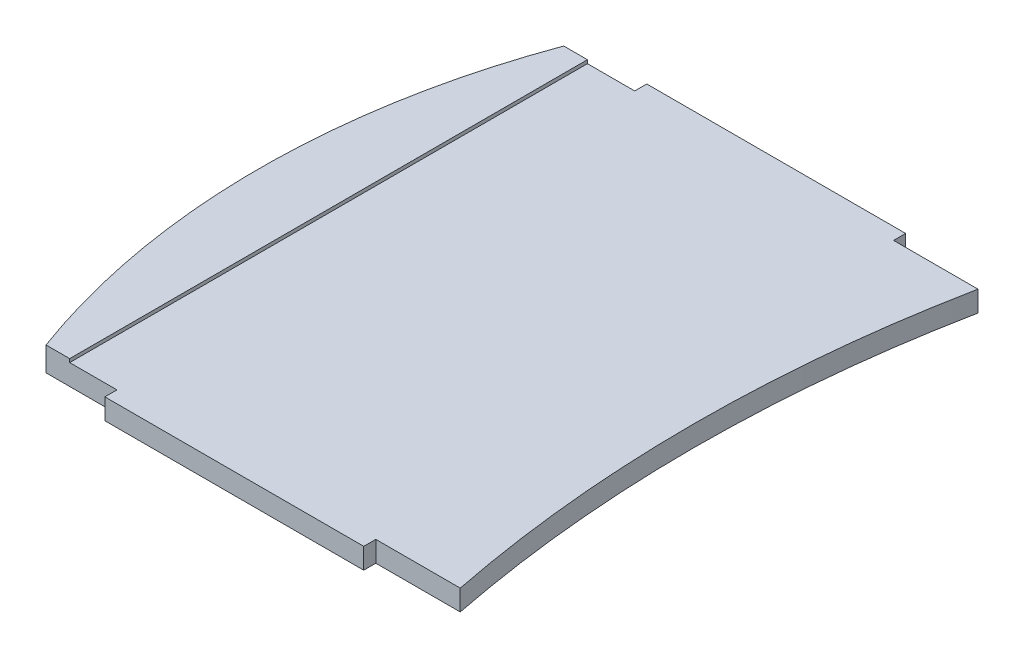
ISO-10303-21;
HEADER;
FILE_DESCRIPTION(('STEP AP214'),'2;1');
FILE_NAME('part.step','',(''),(''),'','','');
FILE_SCHEMA(('AUTOMOTIVE_DESIGN { 1 0 10303 214 1 1 1 1 }'));
ENDSEC;
DATA;
#1=APPLICATION_CONTEXT('core data for automotive mechanical design processes');
#2=APPLICATION_PROTOCOL_DEFINITION('international standard','automotive_design',2000,#1);
#3=PRODUCT_CONTEXT('',#1,'mechanical');
#4=PRODUCT('Part','Part','',(#3));
#5=PRODUCT_RELATED_PRODUCT_CATEGORY('part','',(#4));
#6=PRODUCT_DEFINITION_FORMATION('','',#4);
#7=PRODUCT_DEFINITION_CONTEXT('part definition',#1,'design');
#8=PRODUCT_DEFINITION('design','',#6,#7);
#9=PRODUCT_DEFINITION_SHAPE('','',#8);
#10=(LENGTH_UNIT() NAMED_UNIT(*) SI_UNIT(.MILLI.,.METRE.));
#11=(NAMED_UNIT(*) PLANE_ANGLE_UNIT() SI_UNIT($,.RADIAN.));
#12=(NAMED_UNIT(*) SI_UNIT($,.STERADIAN.) SOLID_ANGLE_UNIT());
#13=UNCERTAINTY_MEASURE_WITH_UNIT(LENGTH_MEASURE(1.E-05),#10,'distance_accuracy_value','');
#14=(GEOMETRIC_REPRESENTATION_CONTEXT(3) GLOBAL_UNCERTAINTY_ASSIGNED_CONTEXT((#13)) GLOBAL_UNIT_ASSIGNED_CONTEXT((#10,
#11,#12)) REPRESENTATION_CONTEXT('',''));
#15=CARTESIAN_POINT('',(0.,0.,0.));
#16=DIRECTION('',(0.,0.,1.));
#17=DIRECTION('',(1.,0.,0.));
#18=AXIS2_PLACEMENT_3D('',#15,#16,#17);
#19=CARTESIAN_POINT('',(-177.216217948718,12.,-182.316442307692));
#20=DIRECTION('',(0.,0.,1.));
#21=DIRECTION('',(1.,0.,0.));
#22=AXIS2_PLACEMENT_3D('',#19,#20,#21);
#23=PLANE('',#22);
#24=DIRECTION('',(-1.,0.,0.));
#25=VECTOR('',#24,1.);
#26=CARTESIAN_POINT('',(-177.216217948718,0.,-182.316442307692));
#27=LINE('',#26,#25);
#28=CARTESIAN_POINT('',(-177.216217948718,0.,-182.316442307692));
#29=VERTEX_POINT('',#28);
#30=CARTESIAN_POINT('',(-218.313277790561,0.,-182.316442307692));
#31=VERTEX_POINT('',#30);
#32=EDGE_CURVE('E133',#29,#31,#27,.T.);
#33=ORIENTED_EDGE('',*,*,#32,.T.);
#34=DIRECTION('',(0.,-1.,0.));
#35=VECTOR('',#34,1.);
#36=CARTESIAN_POINT('',(-218.313277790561,14.,-182.316442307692));
#37=LINE('',#36,#35);
#38=CARTESIAN_POINT('',(-218.313277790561,14.,-182.316442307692));
#39=VERTEX_POINT('',#38);
#40=EDGE_CURVE('E209',#39,#31,#37,.T.);
#41=ORIENTED_EDGE('',*,*,#40,.F.);
#42=DIRECTION('',(1.,0.,0.));
#43=VECTOR('',#42,1.);
#44=CARTESIAN_POINT('',(-204.586217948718,14.,-182.316442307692));
#45=LINE('',#44,#43);
#46=CARTESIAN_POINT('',(-204.586217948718,14.,-182.316442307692));
#47=VERTEX_POINT('',#46);
#48=EDGE_CURVE('E231',#39,#47,#45,.T.);
#49=ORIENTED_EDGE('',*,*,#48,.T.);
#50=DIRECTION('',(0.,-1.,0.));
#51=VECTOR('',#50,1.);
#52=CARTESIAN_POINT('',(-204.586217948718,14.,-182.316442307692));
#53=LINE('',#52,#51);
#54=CARTESIAN_POINT('',(-204.586217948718,12.,-182.316442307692));
#55=VERTEX_POINT('',#54);
#56=EDGE_CURVE('E212',#47,#55,#53,.T.);
#57=ORIENTED_EDGE('',*,*,#56,.T.);
#58=DIRECTION('',(-1.,0.,0.));
#59=VECTOR('',#58,1.);
#60=CARTESIAN_POINT('',(-177.216217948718,12.,-182.316442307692));
#61=LINE('',#60,#59);
#62=CARTESIAN_POINT('',(-177.216217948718,12.,-182.316442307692));
#63=VERTEX_POINT('',#62);
#64=EDGE_CURVE('E153',#63,#55,#61,.T.);
#65=ORIENTED_EDGE('',*,*,#64,.F.);
#66=DIRECTION('',(0.,-1.,0.));
#67=VECTOR('',#66,1.);
#68=CARTESIAN_POINT('',(-177.216217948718,12.,-182.316442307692));
#69=LINE('',#68,#67);
#70=EDGE_CURVE('E129',#63,#29,#69,.T.);
#71=ORIENTED_EDGE('',*,*,#70,.T.);
#72=EDGE_LOOP('',(#33,#41,#49,#57,#65,#71));
#73=FACE_BOUND('',#72,.T.);
#74=ADVANCED_FACE('F32',(#73),#23,.F.);
#75=CARTESIAN_POINT('',(-239.016217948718,12.,117.683557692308));
#76=DIRECTION('',(0.,0.,-1.));
#77=DIRECTION('',(-1.,0.,0.));
#78=AXIS2_PLACEMENT_3D('',#75,#76,#77);
#79=PLANE('',#78);
#80=DIRECTION('',(1.,0.,0.));
#81=VECTOR('',#80,1.);
#82=CARTESIAN_POINT('',(-239.016217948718,12.,117.683557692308));
#83=LINE('',#82,#81);
#84=CARTESIAN_POINT('',(-204.586217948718,12.,117.683557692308));
#85=VERTEX_POINT('',#84);
#86=CARTESIAN_POINT('',(-177.216217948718,12.,117.683557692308));
#87=VERTEX_POINT('',#86);
#88=EDGE_CURVE('E92',#85,#87,#83,.T.);
#89=ORIENTED_EDGE('',*,*,#88,.F.);
#90=DIRECTION('',(0.,-1.,0.));
#91=VECTOR('',#90,1.);
#92=CARTESIAN_POINT('',(-204.586217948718,14.,117.683557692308));
#93=LINE('',#92,#91);
#94=CARTESIAN_POINT('',(-204.586217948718,14.,117.683557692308));
#95=VERTEX_POINT('',#94);
#96=EDGE_CURVE('E216',#95,#85,#93,.T.);
#97=ORIENTED_EDGE('',*,*,#96,.F.);
#98=DIRECTION('',(-1.,0.,0.));
#99=VECTOR('',#98,1.);
#100=CARTESIAN_POINT('',(-204.586217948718,14.,117.683557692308));
#101=LINE('',#100,#99);
#102=CARTESIAN_POINT('',(-218.313277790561,14.,117.683557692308));
#103=VERTEX_POINT('',#102);
#104=EDGE_CURVE('E213',#95,#103,#101,.T.);
#105=ORIENTED_EDGE('',*,*,#104,.T.);
#106=DIRECTION('',(0.,-1.,0.));
#107=VECTOR('',#106,1.);
#108=CARTESIAN_POINT('',(-218.313277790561,14.,117.683557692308));
#109=LINE('',#108,#107);
#110=CARTESIAN_POINT('',(-218.313277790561,0.,117.683557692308));
#111=VERTEX_POINT('',#110);
#112=EDGE_CURVE('E208',#103,#111,#109,.T.);
#113=ORIENTED_EDGE('',*,*,#112,.T.);
#114=DIRECTION('',(1.,0.,0.));
#115=VECTOR('',#114,1.);
#116=CARTESIAN_POINT('',(-239.016217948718,0.,117.683557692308));
#117=LINE('',#116,#115);
#118=CARTESIAN_POINT('',(-177.216217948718,0.,117.683557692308));
#119=VERTEX_POINT('',#118);
#120=EDGE_CURVE('E136',#111,#119,#117,.T.);
#121=ORIENTED_EDGE('',*,*,#120,.T.);
#122=DIRECTION('',(0.,-1.,0.));
#123=VECTOR('',#122,1.);
#124=CARTESIAN_POINT('',(-177.216217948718,12.,117.683557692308));
#125=LINE('',#124,#123);
#126=EDGE_CURVE('E11',#87,#119,#125,.T.);
#127=ORIENTED_EDGE('',*,*,#126,.F.);
#128=EDGE_LOOP('',(#89,#97,#105,#113,#121,#127));
#129=FACE_BOUND('',#128,.T.);
#130=ADVANCED_FACE('F274',(#129),#79,.F.);
#131=CARTESIAN_POINT('',(-177.216217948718,12.,117.683557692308));
#132=DIRECTION('',(1.,0.,0.));
#133=DIRECTION('',(0.,0.,-1.));
#134=AXIS2_PLACEMENT_3D('',#131,#132,#133);
#135=PLANE('',#134);
#136=DIRECTION('',(0.,0.,1.));
#137=VECTOR('',#136,1.);
#138=CARTESIAN_POINT('',(-177.216217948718,0.,117.683557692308));
#139=LINE('',#138,#137);
#140=CARTESIAN_POINT('',(-177.216217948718,0.,124.683557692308));
#141=VERTEX_POINT('',#140);
#142=EDGE_CURVE('E139',#119,#141,#139,.T.);
#143=ORIENTED_EDGE('',*,*,#142,.T.);
#144=DIRECTION('',(0.,-1.,0.));
#145=VECTOR('',#144,1.);
#146=CARTESIAN_POINT('',(-177.216217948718,12.,124.683557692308));
#147=LINE('',#146,#145);
#148=CARTESIAN_POINT('',(-177.216217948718,12.,124.683557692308));
#149=VERTEX_POINT('',#148);
#150=EDGE_CURVE('E40',#149,#141,#147,.T.);
#151=ORIENTED_EDGE('',*,*,#150,.F.);
#152=DIRECTION('',(0.,0.,1.));
#153=VECTOR('',#152,1.);
#154=CARTESIAN_POINT('',(-177.216217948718,12.,117.683557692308));
#155=LINE('',#154,#153);
#156=EDGE_CURVE('E198',#87,#149,#155,.T.);
#157=ORIENTED_EDGE('',*,*,#156,.F.);
#158=ORIENTED_EDGE('',*,*,#126,.T.);
#159=EDGE_LOOP('',(#143,#151,#157,#158));
#160=FACE_BOUND('',#159,.T.);
#161=ADVANCED_FACE('F285',(#160),#135,.F.);
#162=CARTESIAN_POINT('',(-177.216217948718,12.,124.683557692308));
#163=DIRECTION('',(0.,0.,-1.));
#164=DIRECTION('',(-1.,0.,0.));
#165=AXIS2_PLACEMENT_3D('',#162,#163,#164);
#166=PLANE('',#165);
#167=DIRECTION('',(1.,0.,0.));
#168=VECTOR('',#167,1.);
#169=CARTESIAN_POINT('',(-177.216217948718,0.,124.683557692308));
#170=LINE('',#169,#168);
#171=CARTESIAN_POINT('',(-27.216217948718,0.,124.683557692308));
#172=VERTEX_POINT('',#171);
#173=EDGE_CURVE('E141',#141,#172,#170,.T.);
#174=ORIENTED_EDGE('',*,*,#173,.T.);
#175=DIRECTION('',(0.,-1.,0.));
#176=VECTOR('',#175,1.);
#177=CARTESIAN_POINT('',(-27.216217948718,12.,124.683557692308));
#178=LINE('',#177,#176);
#179=CARTESIAN_POINT('',(-27.216217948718,12.,124.683557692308));
#180=VERTEX_POINT('',#179);
#181=EDGE_CURVE('E160',#180,#172,#178,.T.);
#182=ORIENTED_EDGE('',*,*,#181,.F.);
#183=DIRECTION('',(1.,0.,0.));
#184=VECTOR('',#183,1.);
#185=CARTESIAN_POINT('',(-177.216217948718,12.,124.683557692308));
#186=LINE('',#185,#184);
#187=EDGE_CURVE('E169',#149,#180,#186,.T.);
#188=ORIENTED_EDGE('',*,*,#187,.F.);
#189=ORIENTED_EDGE('',*,*,#150,.T.);
#190=EDGE_LOOP('',(#174,#182,#188,#189));
#191=FACE_BOUND('',#190,.T.);
#192=ADVANCED_FACE('F167',(#191),#166,.F.);
#193=CARTESIAN_POINT('',(-27.216217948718,12.,117.683557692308));
#194=DIRECTION('',(-1.,0.,0.));
#195=DIRECTION('',(0.,0.,1.));
#196=AXIS2_PLACEMENT_3D('',#193,#194,#195);
#197=PLANE('',#196);
#198=DIRECTION('',(0.,0.,-1.));
#199=VECTOR('',#198,1.);
#200=CARTESIAN_POINT('',(-27.216217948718,0.,117.683557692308));
#201=LINE('',#200,#199);
#202=CARTESIAN_POINT('',(-27.216217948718,0.,117.683557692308));
#203=VERTEX_POINT('',#202);
#204=EDGE_CURVE('E143',#172,#203,#201,.T.);
#205=ORIENTED_EDGE('',*,*,#204,.T.);
#206=DIRECTION('',(0.,-1.,0.));
#207=VECTOR('',#206,1.);
#208=CARTESIAN_POINT('',(-27.216217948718,12.,117.683557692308));
#209=LINE('',#208,#207);
#210=CARTESIAN_POINT('',(-27.216217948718,12.,117.683557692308));
#211=VERTEX_POINT('',#210);
#212=EDGE_CURVE('E157',#211,#203,#209,.T.);
#213=ORIENTED_EDGE('',*,*,#212,.F.);
#214=DIRECTION('',(0.,0.,-1.));
#215=VECTOR('',#214,1.);
#216=CARTESIAN_POINT('',(-27.216217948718,12.,117.683557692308));
#217=LINE('',#216,#215);
#218=EDGE_CURVE('E193',#180,#211,#217,.T.);
#219=ORIENTED_EDGE('',*,*,#218,.F.);
#220=ORIENTED_EDGE('',*,*,#181,.T.);
#221=EDGE_LOOP('',(#205,#213,#219,#220));
#222=FACE_BOUND('',#221,.T.);
#223=ADVANCED_FACE('F182',(#222),#197,.F.);
#224=CARTESIAN_POINT('',(-27.216217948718,12.,117.683557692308));
#225=DIRECTION('',(0.,0.,-1.));
#226=DIRECTION('',(-1.,0.,0.));
#227=AXIS2_PLACEMENT_3D('',#224,#225,#226);
#228=PLANE('',#227);
#229=DIRECTION('',(1.,0.,0.));
#230=VECTOR('',#229,1.);
#231=CARTESIAN_POINT('',(-27.216217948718,0.,117.683557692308));
#232=LINE('',#231,#230);
#233=CARTESIAN_POINT('',(21.703782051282,0.,117.683557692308));
#234=VERTEX_POINT('',#233);
#235=EDGE_CURVE('E145',#203,#234,#232,.T.);
#236=ORIENTED_EDGE('',*,*,#235,.T.);
#237=DIRECTION('',(0.,-1.,0.));
#238=VECTOR('',#237,1.);
#239=CARTESIAN_POINT('',(21.703782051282,14.,117.683557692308));
#240=LINE('',#239,#238);
#241=CARTESIAN_POINT('',(21.703782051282,12.,117.683557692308));
#242=VERTEX_POINT('',#241);
#243=EDGE_CURVE('E192',#242,#234,#240,.T.);
#244=ORIENTED_EDGE('',*,*,#243,.F.);
#245=DIRECTION('',(1.,0.,0.));
#246=VECTOR('',#245,1.);
#247=CARTESIAN_POINT('',(-27.216217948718,12.,117.683557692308));
#248=LINE('',#247,#246);
#249=EDGE_CURVE('E190',#211,#242,#248,.T.);
#250=ORIENTED_EDGE('',*,*,#249,.F.);
#251=ORIENTED_EDGE('',*,*,#212,.T.);
#252=EDGE_LOOP('',(#236,#244,#250,#251));
#253=FACE_BOUND('',#252,.T.);
#254=ADVANCED_FACE('F186',(#253),#228,.F.);
#255=CARTESIAN_POINT('',(45.613782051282,12.,-182.316442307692));
#256=DIRECTION('',(0.,0.,1.));
#257=DIRECTION('',(1.,0.,0.));
#258=AXIS2_PLACEMENT_3D('',#255,#256,#257);
#259=PLANE('',#258);
#260=DIRECTION('',(-1.,0.,0.));
#261=VECTOR('',#260,1.);
#262=CARTESIAN_POINT('',(45.613782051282,12.,-182.316442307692));
#263=LINE('',#262,#261);
#264=CARTESIAN_POINT('',(21.7037820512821,12.,-182.316442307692));
#265=VERTEX_POINT('',#264);
#266=CARTESIAN_POINT('',(-27.216217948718,12.,-182.316442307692));
#267=VERTEX_POINT('',#266);
#268=EDGE_CURVE('E115',#265,#267,#263,.T.);
#269=ORIENTED_EDGE('',*,*,#268,.F.);
#270=DIRECTION('',(0.,-1.,0.));
#271=VECTOR('',#270,1.);
#272=CARTESIAN_POINT('',(21.7037820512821,12.,-182.316442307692));
#273=LINE('',#272,#271);
#274=CARTESIAN_POINT('',(21.7037820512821,0.,-182.316442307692));
#275=VERTEX_POINT('',#274);
#276=EDGE_CURVE('E137',#265,#275,#273,.T.);
#277=ORIENTED_EDGE('',*,*,#276,.T.);
#278=DIRECTION('',(-1.,0.,0.));
#279=VECTOR('',#278,1.);
#280=CARTESIAN_POINT('',(45.613782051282,0.,-182.316442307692));
#281=LINE('',#280,#279);
#282=CARTESIAN_POINT('',(-27.216217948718,0.,-182.316442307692));
#283=VERTEX_POINT('',#282);
#284=EDGE_CURVE('E148',#275,#283,#281,.T.);
#285=ORIENTED_EDGE('',*,*,#284,.T.);
#286=DIRECTION('',(0.,-1.,0.));
#287=VECTOR('',#286,1.);
#288=CARTESIAN_POINT('',(-27.216217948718,12.,-182.316442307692));
#289=LINE('',#288,#287);
#290=EDGE_CURVE('E124',#267,#283,#289,.T.);
#291=ORIENTED_EDGE('',*,*,#290,.F.);
#292=EDGE_LOOP('',(#269,#277,#285,#291));
#293=FACE_BOUND('',#292,.T.);
#294=ADVANCED_FACE('F247',(#293),#259,.F.);
#295=CARTESIAN_POINT('',(-27.216217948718,12.,-182.316442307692));
#296=DIRECTION('',(-1.,0.,0.));
#297=DIRECTION('',(0.,0.,1.));
#298=AXIS2_PLACEMENT_3D('',#295,#296,#297);
#299=PLANE('',#298);
#300=DIRECTION('',(0.,0.,-1.));
#301=VECTOR('',#300,1.);
#302=CARTESIAN_POINT('',(-27.216217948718,0.,-182.316442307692));
#303=LINE('',#302,#301);
#304=CARTESIAN_POINT('',(-27.216217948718,0.,-189.316442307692));
#305=VERTEX_POINT('',#304);
#306=EDGE_CURVE('E123',#283,#305,#303,.T.);
#307=ORIENTED_EDGE('',*,*,#306,.T.);
#308=DIRECTION('',(0.,-1.,0.));
#309=VECTOR('',#308,1.);
#310=CARTESIAN_POINT('',(-27.216217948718,12.,-189.316442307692));
#311=LINE('',#310,#309);
#312=CARTESIAN_POINT('',(-27.216217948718,12.,-189.316442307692));
#313=VERTEX_POINT('',#312);
#314=EDGE_CURVE('E120',#313,#305,#311,.T.);
#315=ORIENTED_EDGE('',*,*,#314,.F.);
#316=DIRECTION('',(0.,0.,-1.));
#317=VECTOR('',#316,1.);
#318=CARTESIAN_POINT('',(-27.216217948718,12.,-182.316442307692));
#319=LINE('',#318,#317);
#320=EDGE_CURVE('E108',#267,#313,#319,.T.);
#321=ORIENTED_EDGE('',*,*,#320,.F.);
#322=ORIENTED_EDGE('',*,*,#290,.T.);
#323=EDGE_LOOP('',(#307,#315,#321,#322));
#324=FACE_BOUND('',#323,.T.);
#325=ADVANCED_FACE('F121',(#324),#299,.F.);
#326=CARTESIAN_POINT('',(-177.216217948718,12.,-189.316442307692));
#327=DIRECTION('',(0.,0.,1.));
#328=DIRECTION('',(1.,0.,0.));
#329=AXIS2_PLACEMENT_3D('',#326,#327,#328);
#330=PLANE('',#329);
#331=DIRECTION('',(-1.,0.,0.));
#332=VECTOR('',#331,1.);
#333=CARTESIAN_POINT('',(-177.216217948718,0.,-189.316442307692));
#334=LINE('',#333,#332);
#335=CARTESIAN_POINT('',(-177.216217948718,0.,-189.316442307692));
#336=VERTEX_POINT('',#335);
#337=EDGE_CURVE('E78',#305,#336,#334,.T.);
#338=ORIENTED_EDGE('',*,*,#337,.T.);
#339=DIRECTION('',(0.,-1.,0.));
#340=VECTOR('',#339,1.);
#341=CARTESIAN_POINT('',(-177.216217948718,12.,-189.316442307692));
#342=LINE('',#341,#340);
#343=CARTESIAN_POINT('',(-177.216217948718,12.,-189.316442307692));
#344=VERTEX_POINT('',#343);
#345=EDGE_CURVE('E125',#344,#336,#342,.T.);
#346=ORIENTED_EDGE('',*,*,#345,.F.);
#347=DIRECTION('',(-1.,0.,0.));
#348=VECTOR('',#347,1.);
#349=CARTESIAN_POINT('',(-177.216217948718,12.,-189.316442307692));
#350=LINE('',#349,#348);
#351=EDGE_CURVE('E113',#313,#344,#350,.T.);
#352=ORIENTED_EDGE('',*,*,#351,.F.);
#353=ORIENTED_EDGE('',*,*,#314,.T.);
#354=EDGE_LOOP('',(#338,#346,#352,#353));
#355=FACE_BOUND('',#354,.T.);
#356=ADVANCED_FACE('F127',(#355),#330,.F.);
#357=CARTESIAN_POINT('',(-177.216217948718,12.,-182.316442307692));
#358=DIRECTION('',(1.,0.,0.));
#359=DIRECTION('',(0.,0.,-1.));
#360=AXIS2_PLACEMENT_3D('',#357,#358,#359);
#361=PLANE('',#360);
#362=DIRECTION('',(0.,0.,1.));
#363=VECTOR('',#362,1.);
#364=CARTESIAN_POINT('',(-177.216217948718,0.,-182.316442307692));
#365=LINE('',#364,#363);
#366=EDGE_CURVE('E84',#336,#29,#365,.T.);
#367=ORIENTED_EDGE('',*,*,#366,.T.);
#368=ORIENTED_EDGE('',*,*,#70,.F.);
#369=DIRECTION('',(0.,0.,1.));
#370=VECTOR('',#369,1.);
#371=CARTESIAN_POINT('',(-177.216217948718,12.,-182.316442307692));
#372=LINE('',#371,#370);
#373=EDGE_CURVE('E48',#344,#63,#372,.T.);
#374=ORIENTED_EDGE('',*,*,#373,.F.);
#375=ORIENTED_EDGE('',*,*,#345,.T.);
#376=EDGE_LOOP('',(#367,#368,#374,#375));
#377=FACE_BOUND('',#376,.T.);
#378=ADVANCED_FACE('F359',(#377),#361,.F.);
#379=CARTESIAN_POINT('',(0.,12.,0.));
#380=DIRECTION('',(0.,1.,0.));
#381=DIRECTION('',(0.,0.,1.));
#382=AXIS2_PLACEMENT_3D('',#379,#380,#381);
#383=PLANE('',#382);
#384=CARTESIAN_POINT('',(775.893749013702,12.,-32.3164423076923));
#385=DIRECTION('',(0.,1.,0.));
#386=DIRECTION('',(0.,0.,1.));
#387=AXIS2_PLACEMENT_3D('',#384,#385,#386);
#388=CIRCLE('',#387,768.961966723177);
#389=EDGE_CURVE('E225',#265,#242,#388,.T.);
#390=ORIENTED_EDGE('',*,*,#389,.F.);
#391=ORIENTED_EDGE('',*,*,#268,.T.);
#392=ORIENTED_EDGE('',*,*,#320,.T.);
#393=ORIENTED_EDGE('',*,*,#351,.T.);
#394=ORIENTED_EDGE('',*,*,#373,.T.);
#395=ORIENTED_EDGE('',*,*,#64,.T.);
#396=DIRECTION('',(0.,0.,-1.));
#397=VECTOR('',#396,1.);
#398=CARTESIAN_POINT('',(-204.586217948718,12.,0.));
#399=LINE('',#398,#397);
#400=EDGE_CURVE('E205',#85,#55,#399,.T.);
#401=ORIENTED_EDGE('',*,*,#400,.F.);
#402=ORIENTED_EDGE('',*,*,#88,.T.);
#403=ORIENTED_EDGE('',*,*,#156,.T.);
#404=ORIENTED_EDGE('',*,*,#187,.T.);
#405=ORIENTED_EDGE('',*,*,#218,.T.);
#406=ORIENTED_EDGE('',*,*,#249,.T.);
#407=EDGE_LOOP('',(#390,#391,#392,#393,#394,#395,#401,#402,#403,#404,#405,#406));
#408=FACE_BOUND('',#407,.T.);
#409=ADVANCED_FACE('F111',(#408),#383,.T.);
#410=CARTESIAN_POINT('',(0.,0.,0.));
#411=DIRECTION('',(0.,1.,0.));
#412=DIRECTION('',(0.,0.,1.));
#413=AXIS2_PLACEMENT_3D('',#410,#411,#412);
#414=PLANE('',#413);
#415=ORIENTED_EDGE('',*,*,#284,.F.);
#416=CARTESIAN_POINT('',(775.893749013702,0.,-32.3164423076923));
#417=DIRECTION('',(0.,-1.,0.));
#418=DIRECTION('',(0.,0.,-1.));
#419=AXIS2_PLACEMENT_3D('',#416,#417,#418);
#420=CIRCLE('',#419,768.961966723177);
#421=EDGE_CURVE('E238',#234,#275,#420,.T.);
#422=ORIENTED_EDGE('',*,*,#421,.F.);
#423=ORIENTED_EDGE('',*,*,#235,.F.);
#424=ORIENTED_EDGE('',*,*,#204,.F.);
#425=ORIENTED_EDGE('',*,*,#173,.F.);
#426=ORIENTED_EDGE('',*,*,#142,.F.);
#427=ORIENTED_EDGE('',*,*,#120,.F.);
#428=CARTESIAN_POINT('',(188.799787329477,0.,-32.3164423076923));
#429=DIRECTION('',(0.,-1.,0.));
#430=DIRECTION('',(0.,0.,-1.));
#431=AXIS2_PLACEMENT_3D('',#428,#429,#430);
#432=CIRCLE('',#431,433.86754636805);
#433=EDGE_CURVE('E221',#111,#31,#432,.T.);
#434=ORIENTED_EDGE('',*,*,#433,.T.);
#435=ORIENTED_EDGE('',*,*,#32,.F.);
#436=ORIENTED_EDGE('',*,*,#366,.F.);
#437=ORIENTED_EDGE('',*,*,#337,.F.);
#438=ORIENTED_EDGE('',*,*,#306,.F.);
#439=EDGE_LOOP('',(#415,#422,#423,#424,#425,#426,#427,#434,#435,#436,#437,#438));
#440=FACE_BOUND('',#439,.T.);
#441=ADVANCED_FACE('F176',(#440),#414,.F.);
#442=CARTESIAN_POINT('',(188.799787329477,14.,-32.3164423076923));
#443=DIRECTION('',(0.,-1.,0.));
#444=DIRECTION('',(0.,0.,-1.));
#445=AXIS2_PLACEMENT_3D('',#442,#443,#444);
#446=CYLINDRICAL_SURFACE('',#445,433.86754636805);
#447=ORIENTED_EDGE('',*,*,#433,.F.);
#448=ORIENTED_EDGE('',*,*,#112,.F.);
#449=CARTESIAN_POINT('',(188.799787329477,14.,-32.3164423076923));
#450=DIRECTION('',(0.,-1.,0.));
#451=DIRECTION('',(0.,0.,-1.));
#452=AXIS2_PLACEMENT_3D('',#449,#450,#451);
#453=CIRCLE('',#452,433.86754636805);
#454=EDGE_CURVE('E224',#103,#39,#453,.T.);
#455=ORIENTED_EDGE('',*,*,#454,.T.);
#456=ORIENTED_EDGE('',*,*,#40,.T.);
#457=EDGE_LOOP('',(#447,#448,#455,#456));
#458=FACE_BOUND('',#457,.T.);
#459=ADVANCED_FACE('F259',(#458),#446,.T.);
#460=CARTESIAN_POINT('',(-204.586217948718,14.,117.683557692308));
#461=DIRECTION('',(1.,0.,0.));
#462=DIRECTION('',(0.,0.,-1.));
#463=AXIS2_PLACEMENT_3D('',#460,#461,#462);
#464=PLANE('',#463);
#465=ORIENTED_EDGE('',*,*,#96,.T.);
#466=ORIENTED_EDGE('',*,*,#400,.T.);
#467=ORIENTED_EDGE('',*,*,#56,.F.);
#468=DIRECTION('',(0.,0.,1.));
#469=VECTOR('',#468,1.);
#470=CARTESIAN_POINT('',(-204.586217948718,14.,117.683557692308));
#471=LINE('',#470,#469);
#472=EDGE_CURVE('E228',#47,#95,#471,.T.);
#473=ORIENTED_EDGE('',*,*,#472,.T.);
#474=EDGE_LOOP('',(#465,#466,#467,#473));
#475=FACE_BOUND('',#474,.T.);
#476=ADVANCED_FACE('F278',(#475),#464,.T.);
#477=CARTESIAN_POINT('',(188.799787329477,14.,-32.3164423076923));
#478=DIRECTION('',(0.,-1.,0.));
#479=DIRECTION('',(0.,0.,-1.));
#480=AXIS2_PLACEMENT_3D('',#477,#478,#479);
#481=PLANE('',#480);
#482=ORIENTED_EDGE('',*,*,#454,.F.);
#483=ORIENTED_EDGE('',*,*,#104,.F.);
#484=ORIENTED_EDGE('',*,*,#472,.F.);
#485=ORIENTED_EDGE('',*,*,#48,.F.);
#486=EDGE_LOOP('',(#482,#483,#484,#485));
#487=FACE_BOUND('',#486,.T.);
#488=ADVANCED_FACE('F267',(#487),#481,.F.);
#489=CARTESIAN_POINT('',(775.893749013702,14.,-32.3164423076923));
#490=DIRECTION('',(0.,-1.,0.));
#491=DIRECTION('',(0.,0.,-1.));
#492=AXIS2_PLACEMENT_3D('',#489,#490,#491);
#493=CYLINDRICAL_SURFACE('',#492,768.961966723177);
#494=ORIENTED_EDGE('',*,*,#389,.T.);
#495=ORIENTED_EDGE('',*,*,#243,.T.);
#496=ORIENTED_EDGE('',*,*,#421,.T.);
#497=ORIENTED_EDGE('',*,*,#276,.F.);
#498=EDGE_LOOP('',(#494,#495,#496,#497));
#499=FACE_BOUND('',#498,.T.);
#500=ADVANCED_FACE('F243',(#499),#493,.F.);
#501=CLOSED_SHELL('',(#74,#130,#161,#192,#223,#254,#294,#325,#356,#378,#409,#441,#459,#476,#488,#500));
#502=MANIFOLD_SOLID_BREP('B2',#501);
#503=ADVANCED_BREP_SHAPE_REPRESENTATION('',(#18,#502),#14);
#504=SHAPE_DEFINITION_REPRESENTATION(#9,#503);
ENDSEC;
END-ISO-10303-21;
